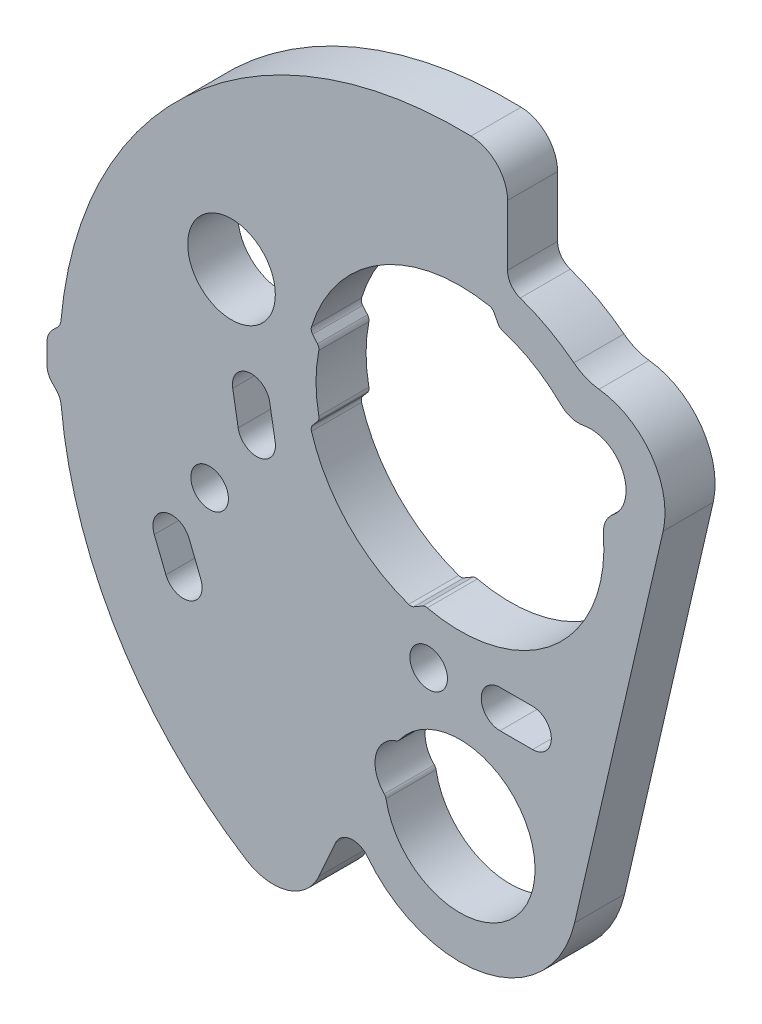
from build123d import *

# Parameters (mm, degrees)
ESTRUSIONE_ESTRUSIONE1_DEPTH = 4
SCHIZZO7_R                   = 1.5
SCHIZZO7_R_2                 = 3.5
TAGLIO_ESTRUSIONE1_DEPTH     = 47.14108798


with BuildPart() as part:
    # Schizzo5 → Estrusione-Estrusione1 (new body)
    with BuildSketch(Plane.XY):
        with BuildLine():
            Line((-32.550814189, 1.848187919), (-32.161232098, 2.23777001))
            ThreePointArc((-32.161232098, 2.23777001), (-31.962473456, 2.521311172), (-31.87232861, 2.8556381))
            ThreePointArc((-31.87232861, 2.8556381), (-21.266391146, 23.911098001), (0.882758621, 31.987821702))
            ThreePointArc((0.882758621, 31.987821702), (2.95038088, 31.080819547), (3.8, 28.988963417))
            Line((3.8, 28.988963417), (3.8, 24.161396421))
            ThreePointArc((3.8, 24.161396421), (4.078556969, 23.290720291), (4.810769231, 22.743421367))
            ThreePointArc((4.810769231, 22.743421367), (7.053091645, 21.754396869), (9.100701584, 20.407744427))
            ThreePointArc((9.100701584, 20.407744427), (10.04750535, 19.856147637), (11.108464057, 19.58217134))
            ThreePointArc((11.108464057, 19.58217134), (15.294279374, 17.096307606), (16.231395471, 12.319029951))
            Line((16.231395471, 12.319029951), (9.159078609, -18.314539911))
            ThreePointArc((9.159078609, -18.314539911), (2.047920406, -25.374204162), (-7.390381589, -22.008808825))
            ThreePointArc((-7.390381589, -22.008808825), (-8.75467392, -21.447195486), (-9.940015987, -22.325641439))
            Line((-9.940015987, -22.325641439), (-11.271816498, -25.316914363))
            ThreePointArc((-11.271816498, -25.316914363), (-13.763630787, -27.517356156), (-17.058283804, -27.074248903))
            ThreePointArc((-17.058283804, -27.074248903), (-27.252648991, -16.771795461), (-31.85634539, -3.028738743))
            ThreePointArc((-31.85634539, -3.028738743), (-31.992544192, -2.531674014), (-32.288951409, -2.110050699))
            Line((-32.288951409, -2.110050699), (-32.550814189, -1.848187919))
            ThreePointArc((-32.550814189, -1.848187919), (-32.868688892, -1.378832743), (-32.989685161, -0.825029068))
            ThreePointArc((-32.989685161, -0.825029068), (-33, 0), (-32.989685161, 0.825029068))
            ThreePointArc((-32.989685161, 0.825029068), (-32.868688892, 1.378832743), (-32.550814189, 1.848187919))
        make_face()
        with BuildLine():
            Line((-11.766757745, 11.945674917), (-11.381571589, 11.486627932))
            ThreePointArc((-11.381571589, 11.486627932), (-11.280120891, 11.288870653), (-11.274402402, 11.066682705))
            ThreePointArc((-11.274402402, 11.066682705), (-11.5, 8.8), (-11.274402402, 6.533317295))
            ThreePointArc((-11.274402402, 6.533317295), (-11.280120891, 6.311129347), (-11.381571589, 6.113372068))
            Line((-11.381571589, 6.113372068), (-11.766757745, 5.654325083))
            ThreePointArc((-11.766757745, 5.654325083), (-11.873644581, 5.432876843), (-11.862043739, 5.187256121))
            ThreePointArc((-11.862043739, 5.187256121), (-8.94710491, 0.214587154), (-4.098884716, -2.902954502))
            ThreePointArc((-4.098884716, -2.902954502), (-3.886998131, -2.928884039), (-3.683607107, -2.864073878))
            Line((-3.683607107, -2.864073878), (-2.973188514, -2.453913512))
            ThreePointArc((-2.973188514, -2.453913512), (-2.796590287, -2.392343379), (-2.609722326, -2.399970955))
            ThreePointArc((-2.609722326, -2.399970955), (7.503526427, 0.085237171), (11.463369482, 9.71714782))
            ThreePointArc((11.463369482, 9.71714782), (11.620762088, 10.669264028), (12.205675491, 11.436840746))
            ThreePointArc((12.205675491, 11.436840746), (13.005516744, 14.864572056), (9.865594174, 16.455161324))
            ThreePointArc((9.865594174, 16.455161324), (8.901621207, 16.500480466), (8.071087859, 16.991919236))
            ThreePointArc((8.071087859, 16.991919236), (5.887688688, 18.678518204), (3.365414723, 19.796544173))
            ThreePointArc((3.365414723, 19.796544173), (3.193642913, 19.888887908), (3.070263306, 20.039919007))
            Line((3.070263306, 20.039919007), (2.710574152, 20.716395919))
            ThreePointArc((2.710574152, 20.716395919), (2.566485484, 20.883608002), (2.364440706, 20.972486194))
            ThreePointArc((2.364440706, 20.972486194), (-6.392840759, 19.425045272), (-11.862043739, 12.412743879))
            ThreePointArc((-11.862043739, 12.412743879), (-11.873644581, 12.167123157), (-11.766757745, 11.945674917))
        make_face(mode=Mode.SUBTRACT)
        with BuildLine():
            ThreePointArc((-5.90684135, -17.253197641), (5.846220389, -17.549706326), (-4.84734238, -12.664003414))
            ThreePointArc((-4.84734238, -12.664003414), (-4.955157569, -12.772210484), (-5.090611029, -12.842816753))
            ThreePointArc((-5.090611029, -12.842816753), (-6.723153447, -14.647837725), (-6.047103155, -16.98583932))
            ThreePointArc((-6.047103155, -16.98583932), (-5.956310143, -17.108678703), (-5.90684135, -17.253197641))
        make_face(mode=Mode.SUBTRACT)
    extrude(amount=-ESTRUSIONE_ESTRUSIONE1_DEPTH)

    # Schizzo7 → Taglio-Estrusione1 (cut, through all)
    with BuildSketch(Plane.XY):
        with Locations((-2.5, -6.5)):
            Circle(SCHIZZO7_R)
        with Locations((-20, -2.8)):
            Circle(SCHIZZO7_R)
        with Locations((-18.25, 13.2)):
            Circle(SCHIZZO7_R_2)
        with BuildLine():
            Line((3.2, -5), (5.8, -5))
            ThreePointArc((5.8, -5), (7.3, -6.5), (5.8, -8))
            Line((5.8, -8), (3.2, -8))
            ThreePointArc((3.2, -8), (1.7, -6.5), (3.2, -5))
        make_face()
        with BuildLine():
            Line((-17.718111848, 2.494685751), (-18.153848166, 5.017329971))
            ThreePointArc((-18.153848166, 5.017329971), (-16.931050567, 6.750756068), (-15.19762447, 5.527958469))
            Line((-15.19762447, 5.527958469), (-14.761888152, 3.005314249))
            ThreePointArc((-14.761888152, 3.005314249), (-15.984685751, 1.271888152), (-17.718111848, 2.494685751))
        make_face()
        with BuildLine():
            Line((-21.635690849, -7.121733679), (-20.70727126, -9.442948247))
            ThreePointArc((-20.70727126, -9.442948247), (-21.542948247, -11.39272874), (-23.49272874, -10.557051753))
            Line((-23.49272874, -10.557051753), (-24.421148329, -8.235837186))
            ThreePointArc((-24.421148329, -8.235837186), (-23.585471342, -6.286056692), (-21.635690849, -7.121733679))
        make_face()
    extrude(amount=-TAGLIO_ESTRUSIONE1_DEPTH, mode=Mode.SUBTRACT)


solid = part.part
